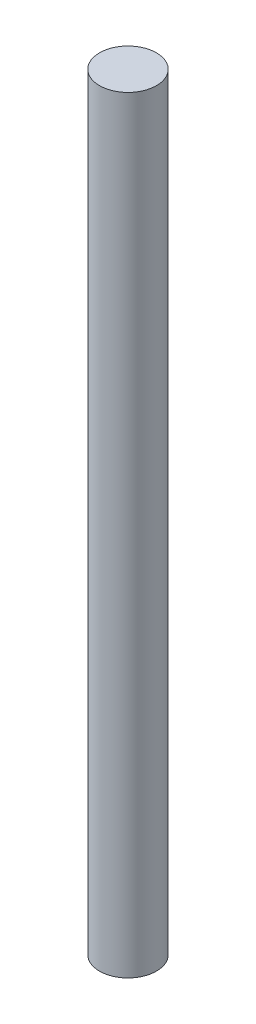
from build123d import *

# Parameters (mm, degrees)
SKETCH1_W = 6
SKETCH1_H = 161.7


with BuildPart() as part:
    # Sketch1 → Revolve1 (revolve)
    with BuildSketch(Plane.XY):
        with Locations((-3, 80.85)):
            Rectangle(SKETCH1_W, SKETCH1_H)
    revolve(axis=Axis((0, 161.7, 0), (0, -1, 0)))


solid = part.part
